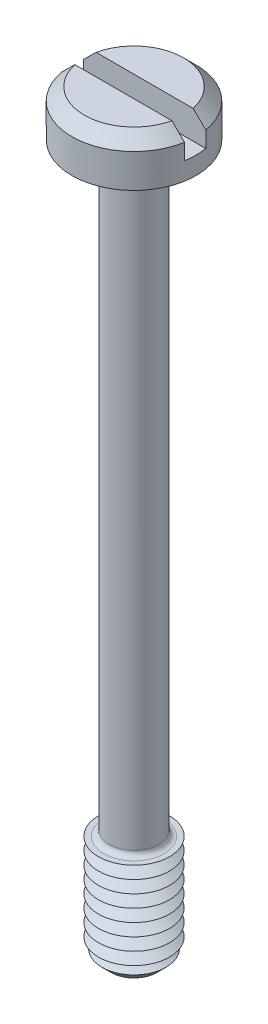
ISO-10303-21;
HEADER;
FILE_DESCRIPTION(('STEP AP214'),'2;1');
FILE_NAME('part.step','',(''),(''),'','','');
FILE_SCHEMA(('AUTOMOTIVE_DESIGN { 1 0 10303 214 1 1 1 1 }'));
ENDSEC;
DATA;
#1=APPLICATION_CONTEXT('core data for automotive mechanical design processes');
#2=APPLICATION_PROTOCOL_DEFINITION('international standard','automotive_design',2000,#1);
#3=PRODUCT_CONTEXT('',#1,'mechanical');
#4=PRODUCT('Part','Part','',(#3));
#5=PRODUCT_RELATED_PRODUCT_CATEGORY('part','',(#4));
#6=PRODUCT_DEFINITION_FORMATION('','',#4);
#7=PRODUCT_DEFINITION_CONTEXT('part definition',#1,'design');
#8=PRODUCT_DEFINITION('design','',#6,#7);
#9=PRODUCT_DEFINITION_SHAPE('','',#8);
#10=(LENGTH_UNIT() NAMED_UNIT(*) SI_UNIT(.MILLI.,.METRE.));
#11=(NAMED_UNIT(*) PLANE_ANGLE_UNIT() SI_UNIT($,.RADIAN.));
#12=(NAMED_UNIT(*) SI_UNIT($,.STERADIAN.) SOLID_ANGLE_UNIT());
#13=UNCERTAINTY_MEASURE_WITH_UNIT(LENGTH_MEASURE(1.E-05),#10,'distance_accuracy_value','');
#14=(GEOMETRIC_REPRESENTATION_CONTEXT(3) GLOBAL_UNCERTAINTY_ASSIGNED_CONTEXT((#13)) GLOBAL_UNIT_ASSIGNED_CONTEXT((#10,
#11,#12)) REPRESENTATION_CONTEXT('',''));
#15=CARTESIAN_POINT('',(0.,0.,0.));
#16=DIRECTION('',(0.,0.,1.));
#17=DIRECTION('',(1.,0.,0.));
#18=AXIS2_PLACEMENT_3D('',#15,#16,#17);
#19=CARTESIAN_POINT('',(0.,2.6,0.));
#20=DIRECTION('',(0.,1.,0.));
#21=DIRECTION('',(0.,0.,1.));
#22=AXIS2_PLACEMENT_3D('',#19,#20,#21);
#23=PLANE('',#22);
#24=DIRECTION('',(-1.,0.,0.));
#25=VECTOR('',#24,1.);
#26=CARTESIAN_POINT('',(3.5,2.6,-0.6));
#27=LINE('',#26,#25);
#28=CARTESIAN_POINT('',(2.73495886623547,2.6,-0.6));
#29=VERTEX_POINT('',#28);
#30=CARTESIAN_POINT('',(-2.73495886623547,2.6,-0.6));
#31=VERTEX_POINT('',#30);
#32=EDGE_CURVE('E110',#29,#31,#27,.T.);
#33=ORIENTED_EDGE('',*,*,#32,.F.);
#34=CARTESIAN_POINT('',(0.,2.6,0.));
#35=DIRECTION('',(0.,1.,0.));
#36=DIRECTION('',(0.,0.,1.));
#37=AXIS2_PLACEMENT_3D('',#34,#35,#36);
#38=CIRCLE('',#37,2.8);
#39=EDGE_CURVE('E113',#29,#31,#38,.T.);
#40=ORIENTED_EDGE('',*,*,#39,.T.);
#41=EDGE_LOOP('',(#33,#40));
#42=FACE_BOUND('',#41,.T.);
#43=ADVANCED_FACE('F39',(#42),#23,.T.);
#44=CARTESIAN_POINT('',(0.,2.6,0.));
#45=DIRECTION('',(0.,-1.,0.));
#46=DIRECTION('',(0.,0.,-1.));
#47=AXIS2_PLACEMENT_3D('',#44,#45,#46);
#48=CONICAL_SURFACE('',#47,2.8,0.785398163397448);
#49=CARTESIAN_POINT('',(7.69779986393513,-2.32114776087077,-0.6));
#50=CARTESIAN_POINT('',(7.42456340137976,-2.0487448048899,-0.6));
#51=CARTESIAN_POINT('',(7.15128998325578,-1.77637887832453,-0.6));
#52=CARTESIAN_POINT('',(6.60460779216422,-1.23176088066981,-0.6));
#53=CARTESIAN_POINT('',(6.33119901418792,-0.959508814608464,-0.6));
#54=CARTESIAN_POINT('',(5.78393918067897,-0.414914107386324,-0.6));
#55=CARTESIAN_POINT('',(5.5100879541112,-0.142571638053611,-0.6));
#56=CARTESIAN_POINT('',(4.9621249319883,0.401829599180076,-0.6));
#57=CARTESIAN_POINT('',(4.68801314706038,0.673888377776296,-0.6));
#58=CARTESIAN_POINT('',(4.15230810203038,1.204717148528,-0.6));
#59=CARTESIAN_POINT('',(3.89073524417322,1.46350771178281,-0.6));
#60=CARTESIAN_POINT('',(3.49781694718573,1.85115830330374,-0.6));
#61=CARTESIAN_POINT('',(3.36674319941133,1.98029362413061,-0.6));
#62=CARTESIAN_POINT('',(3.10433907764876,2.23830030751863,-0.6));
#63=CARTESIAN_POINT('',(2.97300870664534,2.36717167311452,-0.6));
#64=CARTESIAN_POINT('',(2.71005235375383,2.62445652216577,-0.6));
#65=CARTESIAN_POINT('',(2.57842659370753,2.75287023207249,-0.6));
#66=CARTESIAN_POINT('',(2.31459302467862,3.00911021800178,-0.6));
#67=CARTESIAN_POINT('',(2.1823851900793,3.13693646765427,-0.6));
#68=CARTESIAN_POINT('',(1.91706128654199,3.39159289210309,-0.6));
#69=CARTESIAN_POINT('',(1.78394541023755,3.51842326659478,-0.6));
#70=CARTESIAN_POINT('',(1.5829745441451,3.70728046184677,-0.6));
#71=CARTESIAN_POINT('',(1.51577053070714,3.76999922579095,-0.6));
#72=CARTESIAN_POINT('',(1.38073587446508,3.89475766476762,-0.6));
#73=CARTESIAN_POINT('',(1.31290524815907,3.95679735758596,-0.6));
#74=CARTESIAN_POINT('',(1.20662362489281,4.05253127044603,-0.6));
#75=CARTESIAN_POINT('',(1.16849592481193,4.08658409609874,-0.6));
#76=CARTESIAN_POINT('',(1.09186306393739,4.15427097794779,-0.6));
#77=CARTESIAN_POINT('',(1.05335786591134,4.18790499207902,-0.6));
#78=CARTESIAN_POINT('',(0.975560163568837,4.25487029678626,-0.6));
#79=CARTESIAN_POINT('',(0.936263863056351,4.28819718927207,-0.6));
#80=CARTESIAN_POINT('',(0.857023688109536,4.35405392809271,-0.6));
#81=CARTESIAN_POINT('',(0.817079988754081,4.38658398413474,-0.6));
#82=CARTESIAN_POINT('',(0.73593206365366,4.45080389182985,-0.6));
#83=CARTESIAN_POINT('',(0.694719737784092,4.48248357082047,-0.6));
#84=CARTESIAN_POINT('',(0.611023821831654,4.54411116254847,-0.6));
#85=CARTESIAN_POINT('',(0.568540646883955,4.57405963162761,-0.6));
#86=CARTESIAN_POINT('',(0.482031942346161,4.63104137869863,-0.6));
#87=CARTESIAN_POINT('',(0.438018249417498,4.65809235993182,-0.6));
#88=CARTESIAN_POINT('',(0.347545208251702,4.70764477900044,-0.6));
#89=CARTESIAN_POINT('',(0.301093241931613,4.73015905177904,-0.6));
#90=CARTESIAN_POINT('',(0.216840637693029,4.76288589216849,-0.6));
#91=CARTESIAN_POINT('',(0.179711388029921,4.77476119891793,-0.6));
#92=CARTESIAN_POINT('',(0.104069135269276,4.79214056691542,-0.6));
#93=CARTESIAN_POINT('',(0.0655630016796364,4.79767265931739,-0.6));
#94=CARTESIAN_POINT('',(-0.0121083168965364,4.80113734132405,-0.6));
#95=CARTESIAN_POINT('',(-0.0512762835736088,4.79901215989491,-0.6));
#96=CARTESIAN_POINT('',(-0.128601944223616,4.78758103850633,-0.6));
#97=CARTESIAN_POINT('',(-0.166755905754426,4.77825158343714,-0.6));
#98=CARTESIAN_POINT('',(-0.239985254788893,4.75468984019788,-0.6));
#99=CARTESIAN_POINT('',(-0.275121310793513,4.74063623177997,-0.6));
#100=CARTESIAN_POINT('',(-0.343859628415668,4.70912771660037,-0.6));
#101=CARTESIAN_POINT('',(-0.377459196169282,4.6916670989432,-0.6));
#102=CARTESIAN_POINT('',(-0.443620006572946,4.65431398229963,-0.6));
#103=CARTESIAN_POINT('',(-0.476170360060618,4.63440256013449,-0.6));
#104=CARTESIAN_POINT('',(-0.540208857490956,4.59301144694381,-0.6));
#105=CARTESIAN_POINT('',(-0.571697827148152,4.57153301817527,-0.6));
#106=CARTESIAN_POINT('',(-0.636426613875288,4.5256571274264,-0.6));
#107=CARTESIAN_POINT('',(-0.669598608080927,4.50116466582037,-0.6));
#108=CARTESIAN_POINT('',(-0.735238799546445,4.45125092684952,-0.6));
#109=CARTESIAN_POINT('',(-0.767706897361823,4.42582951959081,-0.6));
#110=CARTESIAN_POINT('',(-0.864340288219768,4.34853769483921,-0.6));
#111=CARTESIAN_POINT('',(-0.927700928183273,4.29566444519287,-0.6));
#112=CARTESIAN_POINT('',(-1.05322030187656,4.18829389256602,-0.6));
#113=CARTESIAN_POINT('',(-1.11537654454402,4.13379371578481,-0.6));
#114=CARTESIAN_POINT('',(-1.23879800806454,4.02383276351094,-0.6));
#115=CARTESIAN_POINT('',(-1.30006349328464,3.96837228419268,-0.6));
#116=CARTESIAN_POINT('',(-1.42182653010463,3.85695373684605,-0.6));
#117=CARTESIAN_POINT('',(-1.48232573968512,3.80099747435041,-0.6));
#118=CARTESIAN_POINT('',(-1.60290045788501,3.68862177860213,-0.6));
#119=CARTESIAN_POINT('',(-1.66297593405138,3.63220231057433,-0.6));
#120=CARTESIAN_POINT('',(-1.84259490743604,3.46258196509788,-0.6));
#121=CARTESIAN_POINT('',(-1.96167258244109,3.34888831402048,-0.6));
#122=CARTESIAN_POINT('',(-2.19942862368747,3.12043467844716,-0.6));
#123=CARTESIAN_POINT('',(-2.31810499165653,3.00567262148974,-0.6));
#124=CARTESIAN_POINT('',(-2.55498513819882,2.77566147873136,-0.6));
#125=CARTESIAN_POINT('',(-2.67318891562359,2.66041239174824,-0.6));
#126=CARTESIAN_POINT('',(-3.0273377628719,2.31418176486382,-0.6));
#127=CARTESIAN_POINT('',(-3.26281496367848,2.08272206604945,-0.6));
#128=CARTESIAN_POINT('',(-3.73326607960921,1.61902814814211,-0.6));
#129=CARTESIAN_POINT('',(-3.96823963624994,1.38679356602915,-0.6));
#130=CARTESIAN_POINT('',(-4.43780370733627,0.921942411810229,-0.6));
#131=CARTESIAN_POINT('',(-4.67239422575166,0.6893258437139,-0.6));
#132=CARTESIAN_POINT('',(-5.13982382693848,0.225350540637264,-0.6));
#133=CARTESIAN_POINT('',(-5.37266445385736,-0.00600663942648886,-0.6));
#134=CARTESIAN_POINT('',(-5.83818541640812,-0.468883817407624,-0.6));
#135=CARTESIAN_POINT('',(-6.07086575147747,-0.700403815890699,-0.6));
#136=CARTESIAN_POINT('',(-6.53596926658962,-1.16341429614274,-0.6));
#137=CARTESIAN_POINT('',(-6.76839251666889,-1.39490470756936,-0.6));
#138=CARTESIAN_POINT('',(-7.23315324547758,-1.85796986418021,-0.6));
#139=CARTESIAN_POINT('',(-7.46549072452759,-2.08954460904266,-0.6));
#140=CARTESIAN_POINT('',(-7.69779986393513,-2.32114776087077,-0.6));
#141=B_SPLINE_CURVE_WITH_KNOTS('',3,(#49,#50,#51,#52,#53,#54,#55,#56,#57,#58,#59,#60,#61,#62,
#63,#64,#65,#66,#67,#68,#69,#70,#71,#72,#73,#74,#75,#76,#77,#78,#79,#80,#81,#82,#83,#84,#85,#86,
#87,#88,#89,#90,#91,#92,#93,#94,#95,#96,#97,#98,#99,#100,#101,#102,#103,#104,#105,#106,#107,
#108,#109,#110,#111,#112,#113,#114,#115,#116,#117,#118,#119,#120,#121,#122,#123,#124,#125,#126,
#127,#128,#129,#130,#131,#132,#133,#134,#135,#136,#137,#138,#139,#140),.UNSPECIFIED.,.F.,.F.,(4,
2,2,2,2,2,2,2,2,2,2,2,2,2,2,2,2,2,2,2,2,2,2,2,2,2,2,2,2,2,2,2,2,2,2,2,2,2,2,2,2,2,2,2,2,4),(0.,
1.15747738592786,2.31500139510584,3.47365747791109,4.63226817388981,5.73614050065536,
6.28814234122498,6.84013779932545,7.39180548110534,7.94349768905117,8.49507629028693,
8.77084567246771,9.04660781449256,9.19996738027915,9.35334222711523,9.50791164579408,
9.66243993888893,9.81835637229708,9.9742224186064,10.1290741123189,10.2834813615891,
10.4000294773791,10.5160605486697,10.6329688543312,10.7502603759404,10.8635386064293,
10.9770083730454,11.0914168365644,11.205734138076,11.3294140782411,11.4531113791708,
11.7006314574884,11.9486181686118,12.1965297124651,12.4437540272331,12.6909970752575,
13.184904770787,13.6801705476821,14.1754375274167,15.1659939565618,16.1571087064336,
17.1482131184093,18.1329303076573,19.1176509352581,20.1017623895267,21.0858701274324),.UNSPECIFIED.);
#142=CARTESIAN_POINT('',(3.44818792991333,1.9,-0.6));
#143=VERTEX_POINT('',#142);
#144=EDGE_CURVE('E260',#143,#29,#141,.T.);
#145=ORIENTED_EDGE('',*,*,#144,.F.);
#146=CARTESIAN_POINT('',(0.,1.9,0.));
#147=DIRECTION('',(0.,1.,0.));
#148=DIRECTION('',(0.,0.,1.));
#149=AXIS2_PLACEMENT_3D('',#146,#147,#148);
#150=CIRCLE('',#149,3.5);
#151=CARTESIAN_POINT('',(-3.44818792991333,1.9,-0.6));
#152=VERTEX_POINT('',#151);
#153=EDGE_CURVE('E128',#152,#143,#150,.F.);
#154=ORIENTED_EDGE('',*,*,#153,.F.);
#155=EDGE_CURVE('E102',#31,#152,#141,.T.);
#156=ORIENTED_EDGE('',*,*,#155,.F.);
#157=ORIENTED_EDGE('',*,*,#39,.F.);
#158=EDGE_LOOP('',(#145,#154,#156,#157));
#159=FACE_BOUND('',#158,.T.);
#160=ADVANCED_FACE('F222',(#159),#48,.T.);
#161=CARTESIAN_POINT('',(0.,-40.,0.));
#162=DIRECTION('',(0.,1.,0.));
#163=DIRECTION('',(0.,0.,1.));
#164=AXIS2_PLACEMENT_3D('',#161,#162,#163);
#165=CYLINDRICAL_SURFACE('',#164,1.4);
#166=CARTESIAN_POINT('',(0.,-33.7,0.));
#167=DIRECTION('',(0.,-1.,0.));
#168=DIRECTION('',(0.,0.,-1.));
#169=AXIS2_PLACEMENT_3D('',#166,#167,#168);
#170=CIRCLE('',#169,1.4);
#171=CARTESIAN_POINT('',(0.,-33.7,-1.4));
#172=VERTEX_POINT('',#171);
#173=EDGE_CURVE('E123',#172,#172,#170,.F.);
#174=ORIENTED_EDGE('',*,*,#173,.T.);
#175=EDGE_LOOP('',(#174));
#176=FACE_BOUND('',#175,.T.);
#177=CARTESIAN_POINT('',(0.,-0.300000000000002,0.));
#178=DIRECTION('',(0.,1.,0.));
#179=DIRECTION('',(0.,0.,1.));
#180=AXIS2_PLACEMENT_3D('',#177,#178,#179);
#181=CIRCLE('',#180,1.4);
#182=CARTESIAN_POINT('',(0.,-0.300000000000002,1.4));
#183=VERTEX_POINT('',#182);
#184=EDGE_CURVE('E365',#183,#183,#181,.F.);
#185=ORIENTED_EDGE('',*,*,#184,.T.);
#186=EDGE_LOOP('',(#185));
#187=FACE_BOUND('',#186,.T.);
#188=ADVANCED_FACE('F218',(#176,#187),#165,.T.);
#189=CARTESIAN_POINT('',(0.,2.6,0.));
#190=DIRECTION('',(0.,-1.,0.));
#191=DIRECTION('',(0.,0.,-1.));
#192=AXIS2_PLACEMENT_3D('',#189,#190,#191);
#193=CYLINDRICAL_SURFACE('',#192,3.5);
#194=ORIENTED_EDGE('',*,*,#153,.T.);
#195=DIRECTION('',(0.,-1.,0.));
#196=VECTOR('',#195,1.);
#197=CARTESIAN_POINT('',(3.44818792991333,2.6,-0.6));
#198=LINE('',#197,#196);
#199=CARTESIAN_POINT('',(3.44818792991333,1.,-0.6));
#200=VERTEX_POINT('',#199);
#201=EDGE_CURVE('E64',#143,#200,#198,.T.);
#202=ORIENTED_EDGE('',*,*,#201,.T.);
#203=CARTESIAN_POINT('',(0.,1.,0.));
#204=DIRECTION('',(0.,1.,0.));
#205=DIRECTION('',(0.,0.,1.));
#206=AXIS2_PLACEMENT_3D('',#203,#204,#205);
#207=CIRCLE('',#206,3.5);
#208=CARTESIAN_POINT('',(3.44818792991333,1.,0.6));
#209=VERTEX_POINT('',#208);
#210=EDGE_CURVE('E11',#209,#200,#207,.T.);
#211=ORIENTED_EDGE('',*,*,#210,.F.);
#212=DIRECTION('',(0.,-1.,0.));
#213=VECTOR('',#212,1.);
#214=CARTESIAN_POINT('',(3.44818792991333,2.6,0.6));
#215=LINE('',#214,#213);
#216=CARTESIAN_POINT('',(3.44818792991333,1.9,0.6));
#217=VERTEX_POINT('',#216);
#218=EDGE_CURVE('E276',#209,#217,#215,.F.);
#219=ORIENTED_EDGE('',*,*,#218,.T.);
#220=CARTESIAN_POINT('',(-3.44818792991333,1.9,0.6));
#221=VERTEX_POINT('',#220);
#222=EDGE_CURVE('E120',#217,#221,#150,.F.);
#223=ORIENTED_EDGE('',*,*,#222,.T.);
#224=DIRECTION('',(0.,-1.,0.));
#225=VECTOR('',#224,1.);
#226=CARTESIAN_POINT('',(-3.44818792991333,2.6,0.6));
#227=LINE('',#226,#225);
#228=CARTESIAN_POINT('',(-3.44818792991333,1.,0.6));
#229=VERTEX_POINT('',#228);
#230=EDGE_CURVE('E96',#221,#229,#227,.T.);
#231=ORIENTED_EDGE('',*,*,#230,.T.);
#232=CARTESIAN_POINT('',(-3.44818792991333,1.,-0.6));
#233=VERTEX_POINT('',#232);
#234=EDGE_CURVE('E44',#233,#229,#207,.T.);
#235=ORIENTED_EDGE('',*,*,#234,.F.);
#236=DIRECTION('',(0.,-1.,0.));
#237=VECTOR('',#236,1.);
#238=CARTESIAN_POINT('',(-3.44818792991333,2.6,-0.6));
#239=LINE('',#238,#237);
#240=EDGE_CURVE('E281',#233,#152,#239,.F.);
#241=ORIENTED_EDGE('',*,*,#240,.T.);
#242=EDGE_LOOP('',(#194,#202,#211,#219,#223,#231,#235,#241));
#243=FACE_BOUND('',#242,.T.);
#244=CARTESIAN_POINT('',(0.,0.,0.));
#245=DIRECTION('',(0.,1.,0.));
#246=DIRECTION('',(0.,0.,1.));
#247=AXIS2_PLACEMENT_3D('',#244,#245,#246);
#248=CIRCLE('',#247,3.5);
#249=CARTESIAN_POINT('',(0.,0.,3.5));
#250=VERTEX_POINT('',#249);
#251=EDGE_CURVE('E351',#250,#250,#248,.T.);
#252=ORIENTED_EDGE('',*,*,#251,.T.);
#253=EDGE_LOOP('',(#252));
#254=FACE_BOUND('',#253,.T.);
#255=ADVANCED_FACE('F221',(#243,#254),#193,.T.);
#256=DIRECTION('',(1.,0.,0.));
#257=VECTOR('',#256,1.);
#258=CARTESIAN_POINT('',(3.5,2.6,0.6));
#259=LINE('',#258,#257);
#260=CARTESIAN_POINT('',(-2.73495886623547,2.6,0.6));
#261=VERTEX_POINT('',#260);
#262=CARTESIAN_POINT('',(2.73495886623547,2.6,0.6));
#263=VERTEX_POINT('',#262);
#264=EDGE_CURVE('E56',#261,#263,#259,.T.);
#265=ORIENTED_EDGE('',*,*,#264,.F.);
#266=EDGE_CURVE('E108',#261,#263,#38,.T.);
#267=ORIENTED_EDGE('',*,*,#266,.T.);
#268=EDGE_LOOP('',(#265,#267));
#269=FACE_BOUND('',#268,.T.);
#270=ADVANCED_FACE('F107',(#269),#23,.T.);
#271=CARTESIAN_POINT('',(0.,0.,0.));
#272=DIRECTION('',(0.,1.,0.));
#273=DIRECTION('',(0.,0.,1.));
#274=AXIS2_PLACEMENT_3D('',#271,#272,#273);
#275=PLANE('',#274);
#276=CARTESIAN_POINT('',(0.,0.,0.));
#277=DIRECTION('',(0.,1.,0.));
#278=DIRECTION('',(0.,0.,1.));
#279=AXIS2_PLACEMENT_3D('',#276,#277,#278);
#280=CIRCLE('',#279,1.7);
#281=CARTESIAN_POINT('',(0.,0.,1.7));
#282=VERTEX_POINT('',#281);
#283=EDGE_CURVE('E114',#282,#282,#280,.T.);
#284=ORIENTED_EDGE('',*,*,#283,.T.);
#285=EDGE_LOOP('',(#284));
#286=FACE_BOUND('',#285,.T.);
#287=ORIENTED_EDGE('',*,*,#251,.F.);
#288=EDGE_LOOP('',(#287));
#289=FACE_BOUND('',#288,.T.);
#290=ADVANCED_FACE('F212',(#286,#289),#275,.F.);
#291=CARTESIAN_POINT('',(0.,-34.,0.));
#292=DIRECTION('',(0.,-1.,0.));
#293=DIRECTION('',(0.,0.,-1.));
#294=AXIS2_PLACEMENT_3D('',#291,#292,#293);
#295=PLANE('',#294);
#296=CARTESIAN_POINT('',(0.,-34.,0.));
#297=DIRECTION('',(0.,-1.,0.));
#298=DIRECTION('',(0.,0.,-1.));
#299=AXIS2_PLACEMENT_3D('',#296,#297,#298);
#300=CIRCLE('',#299,1.7);
#301=CARTESIAN_POINT('',(0.,-34.,-1.7));
#302=VERTEX_POINT('',#301);
#303=EDGE_CURVE('E358',#302,#302,#300,.T.);
#304=ORIENTED_EDGE('',*,*,#303,.T.);
#305=EDGE_LOOP('',(#304));
#306=FACE_BOUND('',#305,.T.);
#307=CARTESIAN_POINT('',(0.,-34.,0.));
#308=DIRECTION('',(0.,1.,0.));
#309=DIRECTION('',(0.,0.,1.));
#310=AXIS2_PLACEMENT_3D('',#307,#308,#309);
#311=CIRCLE('',#310,2.);
#312=CARTESIAN_POINT('',(0.,-34.,2.));
#313=VERTEX_POINT('',#312);
#314=EDGE_CURVE('E347',#313,#313,#311,.T.);
#315=ORIENTED_EDGE('',*,*,#314,.T.);
#316=EDGE_LOOP('',(#315));
#317=FACE_BOUND('',#316,.T.);
#318=ADVANCED_FACE('F208',(#306,#317),#295,.F.);
#319=CARTESIAN_POINT('',(0.,-34.35,0.));
#320=DIRECTION('',(0.,1.,0.));
#321=DIRECTION('',(0.,0.,1.));
#322=AXIS2_PLACEMENT_3D('',#319,#320,#321);
#323=CONICAL_SURFACE('',#322,1.39378221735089,1.04719755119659);
#324=ORIENTED_EDGE('',*,*,#314,.F.);
#325=EDGE_LOOP('',(#324));
#326=FACE_BOUND('',#325,.T.);
#327=CARTESIAN_POINT('',(0.,-34.35,0.));
#328=DIRECTION('',(0.,1.,0.));
#329=DIRECTION('',(0.,0.,1.));
#330=AXIS2_PLACEMENT_3D('',#327,#328,#329);
#331=CIRCLE('',#330,1.39378221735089);
#332=CARTESIAN_POINT('',(0.,-34.35,1.39378221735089));
#333=VERTEX_POINT('',#332);
#334=EDGE_CURVE('E343',#333,#333,#331,.T.);
#335=ORIENTED_EDGE('',*,*,#334,.T.);
#336=EDGE_LOOP('',(#335));
#337=FACE_BOUND('',#336,.T.);
#338=ADVANCED_FACE('F204',(#326,#337),#323,.T.);
#339=CARTESIAN_POINT('',(0.,-34.7,0.));
#340=DIRECTION('',(0.,-1.,0.));
#341=DIRECTION('',(0.,0.,-1.));
#342=AXIS2_PLACEMENT_3D('',#339,#340,#341);
#343=CONICAL_SURFACE('',#342,2.,1.0471975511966);
#344=ORIENTED_EDGE('',*,*,#334,.F.);
#345=EDGE_LOOP('',(#344));
#346=FACE_BOUND('',#345,.T.);
#347=CARTESIAN_POINT('',(0.,-34.7,0.));
#348=DIRECTION('',(0.,1.,0.));
#349=DIRECTION('',(0.,0.,1.));
#350=AXIS2_PLACEMENT_3D('',#347,#348,#349);
#351=CIRCLE('',#350,2.);
#352=CARTESIAN_POINT('',(0.,-34.7,2.));
#353=VERTEX_POINT('',#352);
#354=EDGE_CURVE('E339',#353,#353,#351,.T.);
#355=ORIENTED_EDGE('',*,*,#354,.T.);
#356=EDGE_LOOP('',(#355));
#357=FACE_BOUND('',#356,.T.);
#358=ADVANCED_FACE('F200',(#346,#357),#343,.T.);
#359=CARTESIAN_POINT('',(0.,-35.05,0.));
#360=DIRECTION('',(0.,1.,0.));
#361=DIRECTION('',(0.,0.,1.));
#362=AXIS2_PLACEMENT_3D('',#359,#360,#361);
#363=CONICAL_SURFACE('',#362,1.39378221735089,1.04719755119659);
#364=ORIENTED_EDGE('',*,*,#354,.F.);
#365=EDGE_LOOP('',(#364));
#366=FACE_BOUND('',#365,.T.);
#367=CARTESIAN_POINT('',(0.,-35.05,0.));
#368=DIRECTION('',(0.,1.,0.));
#369=DIRECTION('',(0.,0.,1.));
#370=AXIS2_PLACEMENT_3D('',#367,#368,#369);
#371=CIRCLE('',#370,1.39378221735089);
#372=CARTESIAN_POINT('',(0.,-35.05,1.39378221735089));
#373=VERTEX_POINT('',#372);
#374=EDGE_CURVE('E335',#373,#373,#371,.T.);
#375=ORIENTED_EDGE('',*,*,#374,.T.);
#376=EDGE_LOOP('',(#375));
#377=FACE_BOUND('',#376,.T.);
#378=ADVANCED_FACE('F196',(#366,#377),#363,.T.);
#379=CARTESIAN_POINT('',(0.,-35.4,0.));
#380=DIRECTION('',(0.,-1.,0.));
#381=DIRECTION('',(0.,0.,-1.));
#382=AXIS2_PLACEMENT_3D('',#379,#380,#381);
#383=CONICAL_SURFACE('',#382,2.,1.0471975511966);
#384=ORIENTED_EDGE('',*,*,#374,.F.);
#385=EDGE_LOOP('',(#384));
#386=FACE_BOUND('',#385,.T.);
#387=CARTESIAN_POINT('',(0.,-35.4,0.));
#388=DIRECTION('',(0.,1.,0.));
#389=DIRECTION('',(0.,0.,1.));
#390=AXIS2_PLACEMENT_3D('',#387,#388,#389);
#391=CIRCLE('',#390,2.);
#392=CARTESIAN_POINT('',(0.,-35.4,2.));
#393=VERTEX_POINT('',#392);
#394=EDGE_CURVE('E331',#393,#393,#391,.T.);
#395=ORIENTED_EDGE('',*,*,#394,.T.);
#396=EDGE_LOOP('',(#395));
#397=FACE_BOUND('',#396,.T.);
#398=ADVANCED_FACE('F192',(#386,#397),#383,.T.);
#399=CARTESIAN_POINT('',(0.,-35.75,0.));
#400=DIRECTION('',(0.,1.,0.));
#401=DIRECTION('',(0.,0.,1.));
#402=AXIS2_PLACEMENT_3D('',#399,#400,#401);
#403=CONICAL_SURFACE('',#402,1.39378221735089,1.04719755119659);
#404=ORIENTED_EDGE('',*,*,#394,.F.);
#405=EDGE_LOOP('',(#404));
#406=FACE_BOUND('',#405,.T.);
#407=CARTESIAN_POINT('',(0.,-35.75,0.));
#408=DIRECTION('',(0.,1.,0.));
#409=DIRECTION('',(0.,0.,1.));
#410=AXIS2_PLACEMENT_3D('',#407,#408,#409);
#411=CIRCLE('',#410,1.39378221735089);
#412=CARTESIAN_POINT('',(0.,-35.75,1.39378221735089));
#413=VERTEX_POINT('',#412);
#414=EDGE_CURVE('E327',#413,#413,#411,.T.);
#415=ORIENTED_EDGE('',*,*,#414,.T.);
#416=EDGE_LOOP('',(#415));
#417=FACE_BOUND('',#416,.T.);
#418=ADVANCED_FACE('F188',(#406,#417),#403,.T.);
#419=CARTESIAN_POINT('',(0.,-36.1,0.));
#420=DIRECTION('',(0.,-1.,0.));
#421=DIRECTION('',(0.,0.,-1.));
#422=AXIS2_PLACEMENT_3D('',#419,#420,#421);
#423=CONICAL_SURFACE('',#422,2.,1.0471975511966);
#424=ORIENTED_EDGE('',*,*,#414,.F.);
#425=EDGE_LOOP('',(#424));
#426=FACE_BOUND('',#425,.T.);
#427=CARTESIAN_POINT('',(0.,-36.1,0.));
#428=DIRECTION('',(0.,1.,0.));
#429=DIRECTION('',(0.,0.,1.));
#430=AXIS2_PLACEMENT_3D('',#427,#428,#429);
#431=CIRCLE('',#430,2.);
#432=CARTESIAN_POINT('',(0.,-36.1,2.));
#433=VERTEX_POINT('',#432);
#434=EDGE_CURVE('E323',#433,#433,#431,.T.);
#435=ORIENTED_EDGE('',*,*,#434,.T.);
#436=EDGE_LOOP('',(#435));
#437=FACE_BOUND('',#436,.T.);
#438=ADVANCED_FACE('F184',(#426,#437),#423,.T.);
#439=CARTESIAN_POINT('',(0.,-36.45,0.));
#440=DIRECTION('',(0.,1.,0.));
#441=DIRECTION('',(0.,0.,1.));
#442=AXIS2_PLACEMENT_3D('',#439,#440,#441);
#443=CONICAL_SURFACE('',#442,1.39378221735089,1.04719755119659);
#444=ORIENTED_EDGE('',*,*,#434,.F.);
#445=EDGE_LOOP('',(#444));
#446=FACE_BOUND('',#445,.T.);
#447=CARTESIAN_POINT('',(0.,-36.45,0.));
#448=DIRECTION('',(0.,1.,0.));
#449=DIRECTION('',(0.,0.,1.));
#450=AXIS2_PLACEMENT_3D('',#447,#448,#449);
#451=CIRCLE('',#450,1.39378221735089);
#452=CARTESIAN_POINT('',(0.,-36.45,1.39378221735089));
#453=VERTEX_POINT('',#452);
#454=EDGE_CURVE('E319',#453,#453,#451,.T.);
#455=ORIENTED_EDGE('',*,*,#454,.T.);
#456=EDGE_LOOP('',(#455));
#457=FACE_BOUND('',#456,.T.);
#458=ADVANCED_FACE('F180',(#446,#457),#443,.T.);
#459=CARTESIAN_POINT('',(0.,-36.8,0.));
#460=DIRECTION('',(0.,-1.,0.));
#461=DIRECTION('',(0.,0.,-1.));
#462=AXIS2_PLACEMENT_3D('',#459,#460,#461);
#463=CONICAL_SURFACE('',#462,2.,1.0471975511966);
#464=ORIENTED_EDGE('',*,*,#454,.F.);
#465=EDGE_LOOP('',(#464));
#466=FACE_BOUND('',#465,.T.);
#467=CARTESIAN_POINT('',(0.,-36.8,0.));
#468=DIRECTION('',(0.,1.,0.));
#469=DIRECTION('',(0.,0.,1.));
#470=AXIS2_PLACEMENT_3D('',#467,#468,#469);
#471=CIRCLE('',#470,2.);
#472=CARTESIAN_POINT('',(0.,-36.8,2.));
#473=VERTEX_POINT('',#472);
#474=EDGE_CURVE('E316',#473,#473,#471,.T.);
#475=ORIENTED_EDGE('',*,*,#474,.T.);
#476=EDGE_LOOP('',(#475));
#477=FACE_BOUND('',#476,.T.);
#478=ADVANCED_FACE('F176',(#466,#477),#463,.T.);
#479=CARTESIAN_POINT('',(0.,-37.15,0.));
#480=DIRECTION('',(0.,1.,0.));
#481=DIRECTION('',(0.,0.,1.));
#482=AXIS2_PLACEMENT_3D('',#479,#480,#481);
#483=CONICAL_SURFACE('',#482,1.39378221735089,1.04719755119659);
#484=ORIENTED_EDGE('',*,*,#474,.F.);
#485=EDGE_LOOP('',(#484));
#486=FACE_BOUND('',#485,.T.);
#487=CARTESIAN_POINT('',(0.,-37.15,0.));
#488=DIRECTION('',(0.,1.,0.));
#489=DIRECTION('',(0.,0.,1.));
#490=AXIS2_PLACEMENT_3D('',#487,#488,#489);
#491=CIRCLE('',#490,1.39378221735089);
#492=CARTESIAN_POINT('',(0.,-37.15,1.39378221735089));
#493=VERTEX_POINT('',#492);
#494=EDGE_CURVE('E313',#493,#493,#491,.T.);
#495=ORIENTED_EDGE('',*,*,#494,.T.);
#496=EDGE_LOOP('',(#495));
#497=FACE_BOUND('',#496,.T.);
#498=ADVANCED_FACE('F172',(#486,#497),#483,.T.);
#499=CARTESIAN_POINT('',(0.,-37.5,0.));
#500=DIRECTION('',(0.,-1.,0.));
#501=DIRECTION('',(0.,0.,-1.));
#502=AXIS2_PLACEMENT_3D('',#499,#500,#501);
#503=CONICAL_SURFACE('',#502,2.,1.0471975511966);
#504=ORIENTED_EDGE('',*,*,#494,.F.);
#505=EDGE_LOOP('',(#504));
#506=FACE_BOUND('',#505,.T.);
#507=CARTESIAN_POINT('',(0.,-37.5,0.));
#508=DIRECTION('',(0.,1.,0.));
#509=DIRECTION('',(0.,0.,1.));
#510=AXIS2_PLACEMENT_3D('',#507,#508,#509);
#511=CIRCLE('',#510,2.);
#512=CARTESIAN_POINT('',(0.,-37.5,2.));
#513=VERTEX_POINT('',#512);
#514=EDGE_CURVE('E309',#513,#513,#511,.T.);
#515=ORIENTED_EDGE('',*,*,#514,.T.);
#516=EDGE_LOOP('',(#515));
#517=FACE_BOUND('',#516,.T.);
#518=ADVANCED_FACE('F168',(#506,#517),#503,.T.);
#519=CARTESIAN_POINT('',(0.,-37.85,0.));
#520=DIRECTION('',(0.,1.,0.));
#521=DIRECTION('',(0.,0.,1.));
#522=AXIS2_PLACEMENT_3D('',#519,#520,#521);
#523=CONICAL_SURFACE('',#522,1.39378221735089,1.04719755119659);
#524=ORIENTED_EDGE('',*,*,#514,.F.);
#525=EDGE_LOOP('',(#524));
#526=FACE_BOUND('',#525,.T.);
#527=CARTESIAN_POINT('',(0.,-37.85,0.));
#528=DIRECTION('',(0.,1.,0.));
#529=DIRECTION('',(0.,0.,1.));
#530=AXIS2_PLACEMENT_3D('',#527,#528,#529);
#531=CIRCLE('',#530,1.39378221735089);
#532=CARTESIAN_POINT('',(0.,-37.85,1.39378221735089));
#533=VERTEX_POINT('',#532);
#534=EDGE_CURVE('E306',#533,#533,#531,.T.);
#535=ORIENTED_EDGE('',*,*,#534,.T.);
#536=EDGE_LOOP('',(#535));
#537=FACE_BOUND('',#536,.T.);
#538=ADVANCED_FACE('F164',(#526,#537),#523,.T.);
#539=CARTESIAN_POINT('',(0.,-38.2,0.));
#540=DIRECTION('',(0.,-1.,0.));
#541=DIRECTION('',(0.,0.,-1.));
#542=AXIS2_PLACEMENT_3D('',#539,#540,#541);
#543=CONICAL_SURFACE('',#542,2.,1.0471975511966);
#544=ORIENTED_EDGE('',*,*,#534,.F.);
#545=EDGE_LOOP('',(#544));
#546=FACE_BOUND('',#545,.T.);
#547=CARTESIAN_POINT('',(0.,-38.2,0.));
#548=DIRECTION('',(0.,1.,0.));
#549=DIRECTION('',(0.,0.,1.));
#550=AXIS2_PLACEMENT_3D('',#547,#548,#549);
#551=CIRCLE('',#550,2.);
#552=CARTESIAN_POINT('',(0.,-38.2,2.));
#553=VERTEX_POINT('',#552);
#554=EDGE_CURVE('E302',#553,#553,#551,.T.);
#555=ORIENTED_EDGE('',*,*,#554,.T.);
#556=EDGE_LOOP('',(#555));
#557=FACE_BOUND('',#556,.T.);
#558=ADVANCED_FACE('F160',(#546,#557),#543,.T.);
#559=CARTESIAN_POINT('',(0.,-38.55,0.));
#560=DIRECTION('',(0.,1.,0.));
#561=DIRECTION('',(0.,0.,1.));
#562=AXIS2_PLACEMENT_3D('',#559,#560,#561);
#563=CONICAL_SURFACE('',#562,1.39378221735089,1.04719755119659);
#564=ORIENTED_EDGE('',*,*,#554,.F.);
#565=EDGE_LOOP('',(#564));
#566=FACE_BOUND('',#565,.T.);
#567=CARTESIAN_POINT('',(0.,-38.55,0.));
#568=DIRECTION('',(0.,1.,0.));
#569=DIRECTION('',(0.,0.,1.));
#570=AXIS2_PLACEMENT_3D('',#567,#568,#569);
#571=CIRCLE('',#570,1.39378221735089);
#572=CARTESIAN_POINT('',(0.,-38.55,1.39378221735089));
#573=VERTEX_POINT('',#572);
#574=EDGE_CURVE('E299',#573,#573,#571,.T.);
#575=ORIENTED_EDGE('',*,*,#574,.T.);
#576=EDGE_LOOP('',(#575));
#577=FACE_BOUND('',#576,.T.);
#578=ADVANCED_FACE('F156',(#566,#577),#563,.T.);
#579=CARTESIAN_POINT('',(0.,-38.9,0.));
#580=DIRECTION('',(0.,-1.,0.));
#581=DIRECTION('',(0.,0.,-1.));
#582=AXIS2_PLACEMENT_3D('',#579,#580,#581);
#583=CONICAL_SURFACE('',#582,2.,1.0471975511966);
#584=ORIENTED_EDGE('',*,*,#574,.F.);
#585=EDGE_LOOP('',(#584));
#586=FACE_BOUND('',#585,.T.);
#587=CARTESIAN_POINT('',(0.,-38.9,0.));
#588=DIRECTION('',(0.,1.,0.));
#589=DIRECTION('',(0.,0.,1.));
#590=AXIS2_PLACEMENT_3D('',#587,#588,#589);
#591=CIRCLE('',#590,2.);
#592=CARTESIAN_POINT('',(0.,-38.9,2.));
#593=VERTEX_POINT('',#592);
#594=EDGE_CURVE('E294',#593,#593,#591,.T.);
#595=ORIENTED_EDGE('',*,*,#594,.T.);
#596=EDGE_LOOP('',(#595));
#597=FACE_BOUND('',#596,.T.);
#598=ADVANCED_FACE('F152',(#586,#597),#583,.T.);
#599=CARTESIAN_POINT('',(0.,-39.25,0.));
#600=DIRECTION('',(0.,1.,0.));
#601=DIRECTION('',(0.,0.,1.));
#602=AXIS2_PLACEMENT_3D('',#599,#600,#601);
#603=CONICAL_SURFACE('',#602,1.39378221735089,1.04719755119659);
#604=ORIENTED_EDGE('',*,*,#594,.F.);
#605=EDGE_LOOP('',(#604));
#606=FACE_BOUND('',#605,.T.);
#607=CARTESIAN_POINT('',(0.,-39.25,0.));
#608=DIRECTION('',(0.,1.,0.));
#609=DIRECTION('',(0.,0.,1.));
#610=AXIS2_PLACEMENT_3D('',#607,#608,#609);
#611=CIRCLE('',#610,1.39378221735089);
#612=CARTESIAN_POINT('',(0.,-39.25,1.39378221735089));
#613=VERTEX_POINT('',#612);
#614=EDGE_CURVE('E291',#613,#613,#611,.T.);
#615=ORIENTED_EDGE('',*,*,#614,.T.);
#616=EDGE_LOOP('',(#615));
#617=FACE_BOUND('',#616,.T.);
#618=ADVANCED_FACE('F148',(#606,#617),#603,.T.);
#619=CARTESIAN_POINT('',(0.,-39.6,0.));
#620=DIRECTION('',(0.,-1.,0.));
#621=DIRECTION('',(0.,0.,-1.));
#622=AXIS2_PLACEMENT_3D('',#619,#620,#621);
#623=CONICAL_SURFACE('',#622,2.,1.0471975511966);
#624=CARTESIAN_POINT('',(0.,-39.4901923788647,0.));
#625=DIRECTION('',(0.,-1.,0.));
#626=DIRECTION('',(0.,0.,-1.));
#627=AXIS2_PLACEMENT_3D('',#624,#625,#626);
#628=CIRCLE('',#627,1.80980762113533);
#629=CARTESIAN_POINT('',(0.,-39.4901923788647,1.80980762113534));
#630=VERTEX_POINT('',#629);
#631=EDGE_CURVE('E298',#630,#630,#628,.F.);
#632=ORIENTED_EDGE('',*,*,#631,.T.);
#633=EDGE_LOOP('',(#632));
#634=FACE_BOUND('',#633,.T.);
#635=ORIENTED_EDGE('',*,*,#614,.F.);
#636=EDGE_LOOP('',(#635));
#637=FACE_BOUND('',#636,.T.);
#638=ADVANCED_FACE('F144',(#634,#637),#623,.T.);
#639=CARTESIAN_POINT('',(0.,-40.,0.));
#640=DIRECTION('',(0.,-1.,0.));
#641=DIRECTION('',(0.,0.,-1.));
#642=AXIS2_PLACEMENT_3D('',#639,#640,#641);
#643=PLANE('',#642);
#644=CARTESIAN_POINT('',(0.,-40.,0.));
#645=DIRECTION('',(0.,-1.,0.));
#646=DIRECTION('',(0.,0.,-1.));
#647=AXIS2_PLACEMENT_3D('',#644,#645,#646);
#648=CIRCLE('',#647,1.3);
#649=CARTESIAN_POINT('',(0.,-40.,1.30000000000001));
#650=VERTEX_POINT('',#649);
#651=EDGE_CURVE('E355',#650,#650,#648,.T.);
#652=ORIENTED_EDGE('',*,*,#651,.T.);
#653=EDGE_LOOP('',(#652));
#654=FACE_BOUND('',#653,.T.);
#655=ADVANCED_FACE('F147',(#654),#643,.T.);
#656=CARTESIAN_POINT('',(0.,-40.,0.));
#657=DIRECTION('',(0.,1.,0.));
#658=DIRECTION('',(0.,0.,1.));
#659=AXIS2_PLACEMENT_3D('',#656,#657,#658);
#660=CONICAL_SURFACE('',#659,1.3,0.785398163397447);
#661=CARTESIAN_POINT('',(0.,-39.4901923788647,1.80980762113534));
#662=CARTESIAN_POINT('',(0.,-39.4955028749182,1.80449712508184));
#663=CARTESIAN_POINT('',(0.,-39.5008133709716,1.79918662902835));
#664=CARTESIAN_POINT('',(0.,-39.5114343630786,1.78856563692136));
#665=CARTESIAN_POINT('',(0.,-39.5167448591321,1.78325514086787));
#666=CARTESIAN_POINT('',(0.,-39.5273658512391,1.77263414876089));
#667=CARTESIAN_POINT('',(0.,-39.5326763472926,1.76732365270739));
#668=CARTESIAN_POINT('',(0.,-39.5432973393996,1.75670266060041));
#669=CARTESIAN_POINT('',(0.,-39.5486078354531,1.75139216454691));
#670=CARTESIAN_POINT('',(0.,-39.5592288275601,1.74077117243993));
#671=CARTESIAN_POINT('',(0.,-39.5645393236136,1.73546067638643));
#672=CARTESIAN_POINT('',(0.,-39.5751603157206,1.72483968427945));
#673=CARTESIAN_POINT('',(0.,-39.580470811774,1.71952918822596));
#674=CARTESIAN_POINT('',(0.,-39.591091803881,1.70890819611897));
#675=CARTESIAN_POINT('',(0.,-39.5964022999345,1.70359770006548));
#676=CARTESIAN_POINT('',(0.,-39.6070232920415,1.69297670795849));
#677=CARTESIAN_POINT('',(0.,-39.612333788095,1.687666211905));
#678=CARTESIAN_POINT('',(0.,-39.622954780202,1.67704521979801));
#679=CARTESIAN_POINT('',(0.,-39.6282652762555,1.67173472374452));
#680=CARTESIAN_POINT('',(0.,-39.6388862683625,1.66111373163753));
#681=CARTESIAN_POINT('',(0.,-39.644196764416,1.65580323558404));
#682=CARTESIAN_POINT('',(0.,-39.654817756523,1.64518224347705));
#683=CARTESIAN_POINT('',(0.,-39.6601282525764,1.63987174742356));
#684=CARTESIAN_POINT('',(0.,-39.6707492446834,1.62925075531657));
#685=CARTESIAN_POINT('',(0.,-39.6760597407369,1.62394025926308));
#686=CARTESIAN_POINT('',(0.,-39.6866807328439,1.61331926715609));
#687=CARTESIAN_POINT('',(0.,-39.6919912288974,1.6080087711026));
#688=CARTESIAN_POINT('',(0.,-39.7026122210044,1.59738777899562));
#689=CARTESIAN_POINT('',(0.,-39.7079227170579,1.59207728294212));
#690=CARTESIAN_POINT('',(0.,-39.7185437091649,1.58145629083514));
#691=CARTESIAN_POINT('',(0.,-39.7238542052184,1.57614579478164));
#692=CARTESIAN_POINT('',(0.,-39.7344751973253,1.56552480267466));
#693=CARTESIAN_POINT('',(0.,-39.7397856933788,1.56021430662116));
#694=CARTESIAN_POINT('',(0.,-39.7504066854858,1.54959331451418));
#695=CARTESIAN_POINT('',(0.,-39.7557171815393,1.54428281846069));
#696=CARTESIAN_POINT('',(0.,-39.7663381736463,1.5336618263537));
#697=CARTESIAN_POINT('',(0.,-39.7716486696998,1.52835133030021));
#698=CARTESIAN_POINT('',(0.,-39.7822696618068,1.51773033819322));
#699=CARTESIAN_POINT('',(0.,-39.7875801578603,1.51241984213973));
#700=CARTESIAN_POINT('',(0.,-39.7982011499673,1.50179885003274));
#701=CARTESIAN_POINT('',(0.,-39.8035116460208,1.49648835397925));
#702=CARTESIAN_POINT('',(0.,-39.8141326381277,1.48586736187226));
#703=CARTESIAN_POINT('',(0.,-39.8194431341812,1.48055686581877));
#704=CARTESIAN_POINT('',(0.,-39.8300641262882,1.46993587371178));
#705=CARTESIAN_POINT('',(0.,-39.8353746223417,1.46462537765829));
#706=CARTESIAN_POINT('',(0.,-39.8459956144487,1.4540043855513));
#707=CARTESIAN_POINT('',(0.,-39.8513061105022,1.44869388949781));
#708=CARTESIAN_POINT('',(0.,-39.8619271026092,1.43807289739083));
#709=CARTESIAN_POINT('',(0.,-39.8672375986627,1.43276240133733));
#710=CARTESIAN_POINT('',(0.,-39.8778585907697,1.42214140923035));
#711=CARTESIAN_POINT('',(0.,-39.8831690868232,1.41683091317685));
#712=CARTESIAN_POINT('',(0.,-39.8937900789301,1.40620992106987));
#713=CARTESIAN_POINT('',(0.,-39.8991005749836,1.40089942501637));
#714=CARTESIAN_POINT('',(0.,-39.9097215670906,1.39027843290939));
#715=CARTESIAN_POINT('',(0.,-39.9150320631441,1.38496793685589));
#716=CARTESIAN_POINT('',(0.,-39.9256530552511,1.37434694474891));
#717=CARTESIAN_POINT('',(0.,-39.9309635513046,1.36903644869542));
#718=CARTESIAN_POINT('',(0.,-39.9415845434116,1.35841545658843));
#719=CARTESIAN_POINT('',(0.,-39.9468950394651,1.35310496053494));
#720=CARTESIAN_POINT('',(0.,-39.957516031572,1.34248396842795));
#721=CARTESIAN_POINT('',(0.,-39.9628265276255,1.33717347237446));
#722=CARTESIAN_POINT('',(0.,-39.9734475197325,1.32655248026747));
#723=CARTESIAN_POINT('',(0.,-39.978758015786,1.32124198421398));
#724=CARTESIAN_POINT('',(0.,-39.989379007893,1.31062099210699));
#725=CARTESIAN_POINT('',(0.,-39.9946895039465,1.3053104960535));
#726=CARTESIAN_POINT('',(0.,-40.,1.30000000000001));
#727=B_SPLINE_CURVE_WITH_KNOTS('',3,(#661,#662,#663,#664,#665,#666,#667,#668,#669,#670,#671,
#672,#673,#674,#675,#676,#677,#678,#679,#680,#681,#682,#683,#684,#685,#686,#687,#688,#689,#690,
#691,#692,#693,#694,#695,#696,#697,#698,#699,#700,#701,#702,#703,#704,#705,#706,#707,#708,#709,
#710,#711,#712,#713,#714,#715,#716,#717,#718,#719,#720,#721,#722,#723,#724,#725,#726),
.UNSPECIFIED.,.F.,.F.,(4,2,2,2,2,2,2,2,2,2,2,2,2,2,2,2,2,2,2,2,2,2,2,2,2,2,2,2,2,2,2,2,4),(0.,
0.0225305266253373,0.0450610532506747,0.067591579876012,0.0901221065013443,0.112652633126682,
0.135183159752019,0.157713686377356,0.180244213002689,0.202774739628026,0.225305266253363,
0.247835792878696,0.270366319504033,0.29289684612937,0.315427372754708,0.33795789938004,
0.360488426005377,0.383018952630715,0.405549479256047,0.428080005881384,0.450610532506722,
0.473141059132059,0.495671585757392,0.518202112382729,0.540732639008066,0.563263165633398,
0.585793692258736,0.608324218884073,0.63085474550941,0.653385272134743,0.67591579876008,
0.698446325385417,0.720976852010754),.UNSPECIFIED.);
#728=EDGE_CURVE('BSEAM216',#630,#650,#727,.T.);
#729=ORIENTED_EDGE('',*,*,#631,.F.);
#730=ORIENTED_EDGE('',*,*,#651,.F.);
#731=ORIENTED_EDGE('',*,*,#728,.T.);
#732=ORIENTED_EDGE('',*,*,#728,.F.);
#733=EDGE_LOOP('',(#729,#731,#730,#732));
#734=FACE_BOUND('',#733,.T.);
#735=ADVANCED_FACE('F216',(#734),#660,.T.);
#736=CARTESIAN_POINT('',(0.,-33.7,0.));
#737=DIRECTION('',(0.,-1.,0.));
#738=DIRECTION('',(0.,0.,-1.));
#739=AXIS2_PLACEMENT_3D('',#736,#737,#738);
#740=TOROIDAL_SURFACE('',#739,1.7,0.3);
#741=ORIENTED_EDGE('',*,*,#173,.F.);
#742=EDGE_LOOP('',(#741));
#743=FACE_BOUND('',#742,.T.);
#744=ORIENTED_EDGE('',*,*,#303,.F.);
#745=EDGE_LOOP('',(#744));
#746=FACE_BOUND('',#745,.T.);
#747=ADVANCED_FACE('F234',(#743,#746),#740,.F.);
#748=CARTESIAN_POINT('',(0.,-0.300000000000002,0.));
#749=DIRECTION('',(0.,1.,0.));
#750=DIRECTION('',(0.,0.,1.));
#751=AXIS2_PLACEMENT_3D('',#748,#749,#750);
#752=TOROIDAL_SURFACE('',#751,1.7,0.3);
#753=ORIENTED_EDGE('',*,*,#283,.F.);
#754=EDGE_LOOP('',(#753));
#755=FACE_BOUND('',#754,.T.);
#756=ORIENTED_EDGE('',*,*,#184,.F.);
#757=EDGE_LOOP('',(#756));
#758=FACE_BOUND('',#757,.T.);
#759=ADVANCED_FACE('F237',(#755,#758),#752,.F.);
#760=CARTESIAN_POINT('',(-7.69779986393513,-2.32114776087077,0.6));
#761=CARTESIAN_POINT('',(-7.42456340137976,-2.04874480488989,0.6));
#762=CARTESIAN_POINT('',(-7.15128998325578,-1.77637887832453,0.6));
#763=CARTESIAN_POINT('',(-6.60460779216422,-1.23176088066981,0.6));
#764=CARTESIAN_POINT('',(-6.33119901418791,-0.959508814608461,0.6));
#765=CARTESIAN_POINT('',(-5.78393918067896,-0.414914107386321,0.6));
#766=CARTESIAN_POINT('',(-5.5100879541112,-0.142571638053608,0.6));
#767=CARTESIAN_POINT('',(-4.9621249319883,0.401829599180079,0.6));
#768=CARTESIAN_POINT('',(-4.68801314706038,0.673888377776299,0.6));
#769=CARTESIAN_POINT('',(-4.15230810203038,1.204717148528,0.6));
#770=CARTESIAN_POINT('',(-3.89073524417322,1.46350771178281,0.6));
#771=CARTESIAN_POINT('',(-3.49781694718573,1.85115830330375,0.6));
#772=CARTESIAN_POINT('',(-3.36674319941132,1.98029362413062,0.6));
#773=CARTESIAN_POINT('',(-3.10433907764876,2.23830030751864,0.6));
#774=CARTESIAN_POINT('',(-2.97300870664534,2.36717167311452,0.6));
#775=CARTESIAN_POINT('',(-2.71005235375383,2.62445652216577,0.6));
#776=CARTESIAN_POINT('',(-2.57842659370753,2.75287023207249,0.6));
#777=CARTESIAN_POINT('',(-2.31459302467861,3.00911021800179,0.6));
#778=CARTESIAN_POINT('',(-2.1823851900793,3.13693646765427,0.6));
#779=CARTESIAN_POINT('',(-1.91706128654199,3.39159289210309,0.6));
#780=CARTESIAN_POINT('',(-1.78394541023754,3.51842326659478,0.6));
#781=CARTESIAN_POINT('',(-1.5829745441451,3.70728046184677,0.6));
#782=CARTESIAN_POINT('',(-1.51577053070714,3.76999922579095,0.6));
#783=CARTESIAN_POINT('',(-1.38073587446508,3.89475766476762,0.6));
#784=CARTESIAN_POINT('',(-1.31290524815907,3.95679735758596,0.6));
#785=CARTESIAN_POINT('',(-1.20662362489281,4.05253127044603,0.6));
#786=CARTESIAN_POINT('',(-1.16849592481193,4.08658409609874,0.6));
#787=CARTESIAN_POINT('',(-1.09186306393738,4.15427097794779,0.6));
#788=CARTESIAN_POINT('',(-1.05335786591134,4.18790499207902,0.6));
#789=CARTESIAN_POINT('',(-0.975560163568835,4.25487029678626,0.6));
#790=CARTESIAN_POINT('',(-0.936263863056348,4.28819718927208,0.6));
#791=CARTESIAN_POINT('',(-0.857023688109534,4.35405392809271,0.6));
#792=CARTESIAN_POINT('',(-0.817079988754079,4.38658398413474,0.6));
#793=CARTESIAN_POINT('',(-0.735932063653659,4.45080389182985,0.6));
#794=CARTESIAN_POINT('',(-0.694719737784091,4.48248357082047,0.6));
#795=CARTESIAN_POINT('',(-0.611023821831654,4.54411116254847,0.6));
#796=CARTESIAN_POINT('',(-0.568540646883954,4.57405963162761,0.6));
#797=CARTESIAN_POINT('',(-0.482031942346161,4.63104137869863,0.6));
#798=CARTESIAN_POINT('',(-0.438018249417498,4.65809235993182,0.6));
#799=CARTESIAN_POINT('',(-0.347545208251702,4.70764477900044,0.6));
#800=CARTESIAN_POINT('',(-0.301093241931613,4.73015905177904,0.6));
#801=CARTESIAN_POINT('',(-0.216840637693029,4.76288589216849,0.6));
#802=CARTESIAN_POINT('',(-0.179711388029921,4.77476119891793,0.6));
#803=CARTESIAN_POINT('',(-0.104069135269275,4.79214056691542,0.6));
#804=CARTESIAN_POINT('',(-0.065563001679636,4.79767265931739,0.6));
#805=CARTESIAN_POINT('',(0.0121083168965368,4.80113734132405,0.6));
#806=CARTESIAN_POINT('',(0.0512762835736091,4.79901215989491,0.6));
#807=CARTESIAN_POINT('',(0.128601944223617,4.78758103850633,0.6));
#808=CARTESIAN_POINT('',(0.166755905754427,4.77825158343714,0.6));
#809=CARTESIAN_POINT('',(0.239985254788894,4.75468984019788,0.6));
#810=CARTESIAN_POINT('',(0.275121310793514,4.74063623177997,0.6));
#811=CARTESIAN_POINT('',(0.343859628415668,4.70912771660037,0.6));
#812=CARTESIAN_POINT('',(0.377459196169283,4.6916670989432,0.6));
#813=CARTESIAN_POINT('',(0.443620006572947,4.65431398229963,0.6));
#814=CARTESIAN_POINT('',(0.476170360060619,4.63440256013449,0.6));
#815=CARTESIAN_POINT('',(0.540208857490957,4.59301144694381,0.6));
#816=CARTESIAN_POINT('',(0.571697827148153,4.57153301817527,0.6));
#817=CARTESIAN_POINT('',(0.63642661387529,4.5256571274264,0.6));
#818=CARTESIAN_POINT('',(0.669598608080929,4.50116466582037,0.6));
#819=CARTESIAN_POINT('',(0.735238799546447,4.45125092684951,0.6));
#820=CARTESIAN_POINT('',(0.767706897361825,4.42582951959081,0.6));
#821=CARTESIAN_POINT('',(0.864340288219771,4.3485376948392,0.6));
#822=CARTESIAN_POINT('',(0.927700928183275,4.29566444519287,0.6));
#823=CARTESIAN_POINT('',(1.05322030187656,4.18829389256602,0.6));
#824=CARTESIAN_POINT('',(1.11537654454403,4.1337937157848,0.6));
#825=CARTESIAN_POINT('',(1.23879800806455,4.02383276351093,0.6));
#826=CARTESIAN_POINT('',(1.30006349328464,3.96837228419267,0.6));
#827=CARTESIAN_POINT('',(1.42182653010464,3.85695373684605,0.6));
#828=CARTESIAN_POINT('',(1.48232573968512,3.80099747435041,0.6));
#829=CARTESIAN_POINT('',(1.60290045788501,3.68862177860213,0.6));
#830=CARTESIAN_POINT('',(1.66297593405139,3.63220231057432,0.6));
#831=CARTESIAN_POINT('',(1.84259490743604,3.46258196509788,0.6));
#832=CARTESIAN_POINT('',(1.96167258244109,3.34888831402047,0.6));
#833=CARTESIAN_POINT('',(2.19942862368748,3.12043467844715,0.6));
#834=CARTESIAN_POINT('',(2.31810499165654,3.00567262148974,0.6));
#835=CARTESIAN_POINT('',(2.55498513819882,2.77566147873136,0.6));
#836=CARTESIAN_POINT('',(2.67318891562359,2.66041239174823,0.6));
#837=CARTESIAN_POINT('',(3.0273377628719,2.31418176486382,0.6));
#838=CARTESIAN_POINT('',(3.26281496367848,2.08272206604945,0.6));
#839=CARTESIAN_POINT('',(3.73326607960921,1.61902814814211,0.6));
#840=CARTESIAN_POINT('',(3.96823963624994,1.38679356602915,0.6));
#841=CARTESIAN_POINT('',(4.43780370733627,0.921942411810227,0.6));
#842=CARTESIAN_POINT('',(4.67239422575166,0.689325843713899,0.6));
#843=CARTESIAN_POINT('',(5.13982382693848,0.225350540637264,0.6));
#844=CARTESIAN_POINT('',(5.37266445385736,-0.00600663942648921,0.6));
#845=CARTESIAN_POINT('',(5.83818541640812,-0.468883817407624,0.6));
#846=CARTESIAN_POINT('',(6.07086575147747,-0.700403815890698,0.6));
#847=CARTESIAN_POINT('',(6.53596926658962,-1.16341429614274,0.6));
#848=CARTESIAN_POINT('',(6.76839251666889,-1.39490470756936,0.6));
#849=CARTESIAN_POINT('',(7.23315324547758,-1.85796986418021,0.6));
#850=CARTESIAN_POINT('',(7.46549072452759,-2.08954460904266,0.6));
#851=CARTESIAN_POINT('',(7.69779986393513,-2.32114776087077,0.6));
#852=B_SPLINE_CURVE_WITH_KNOTS('',3,(#760,#761,#762,#763,#764,#765,#766,#767,#768,#769,#770,
#771,#772,#773,#774,#775,#776,#777,#778,#779,#780,#781,#782,#783,#784,#785,#786,#787,#788,#789,
#790,#791,#792,#793,#794,#795,#796,#797,#798,#799,#800,#801,#802,#803,#804,#805,#806,#807,#808,
#809,#810,#811,#812,#813,#814,#815,#816,#817,#818,#819,#820,#821,#822,#823,#824,#825,#826,#827,
#828,#829,#830,#831,#832,#833,#834,#835,#836,#837,#838,#839,#840,#841,#842,#843,#844,#845,#846,
#847,#848,#849,#850,#851),.UNSPECIFIED.,.F.,.F.,(4,2,2,2,2,2,2,2,2,2,2,2,2,2,2,2,2,2,2,2,2,2,2,
2,2,2,2,2,2,2,2,2,2,2,2,2,2,2,2,2,2,2,2,2,2,4),(0.,1.15747738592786,2.31500139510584,
3.47365747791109,4.6322681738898,5.73614050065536,6.28814234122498,6.84013779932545,
7.39180548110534,7.94349768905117,8.49507629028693,8.77084567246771,9.04660781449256,
9.19996738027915,9.35334222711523,9.50791164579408,9.66243993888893,9.81835637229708,
9.9742224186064,10.1290741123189,10.2834813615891,10.4000294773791,10.5160605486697,
10.6329688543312,10.7502603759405,10.8635386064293,10.9770083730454,11.0914168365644,
11.205734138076,11.3294140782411,11.4531113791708,11.7006314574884,11.9486181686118,
12.1965297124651,12.4437540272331,12.6909970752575,13.184904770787,13.6801705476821,
14.1754375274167,15.1659939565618,16.1571087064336,17.1482131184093,18.1329303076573,
19.1176509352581,20.1017623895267,21.0858701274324),.UNSPECIFIED.);
#853=EDGE_CURVE('E92',#221,#261,#852,.T.);
#854=ORIENTED_EDGE('',*,*,#853,.F.);
#855=ORIENTED_EDGE('',*,*,#222,.F.);
#856=EDGE_CURVE('E103',#263,#217,#852,.T.);
#857=ORIENTED_EDGE('',*,*,#856,.F.);
#858=ORIENTED_EDGE('',*,*,#266,.F.);
#859=EDGE_LOOP('',(#854,#855,#857,#858));
#860=FACE_BOUND('',#859,.T.);
#861=ADVANCED_FACE('F41',(#860),#48,.T.);
#862=CARTESIAN_POINT('',(0.,1.,0.));
#863=DIRECTION('',(0.,1.,0.));
#864=DIRECTION('',(0.,0.,1.));
#865=AXIS2_PLACEMENT_3D('',#862,#863,#864);
#866=PLANE('',#865);
#867=DIRECTION('',(1.,0.,0.));
#868=VECTOR('',#867,1.);
#869=CARTESIAN_POINT('',(3.5,1.,0.6));
#870=LINE('',#869,#868);
#871=EDGE_CURVE('E257',#229,#209,#870,.T.);
#872=ORIENTED_EDGE('',*,*,#871,.T.);
#873=ORIENTED_EDGE('',*,*,#210,.T.);
#874=DIRECTION('',(-1.,0.,0.));
#875=VECTOR('',#874,1.);
#876=CARTESIAN_POINT('',(3.5,1.,-0.6));
#877=LINE('',#876,#875);
#878=EDGE_CURVE('E273',#200,#233,#877,.T.);
#879=ORIENTED_EDGE('',*,*,#878,.T.);
#880=ORIENTED_EDGE('',*,*,#234,.T.);
#881=EDGE_LOOP('',(#872,#873,#879,#880));
#882=FACE_BOUND('',#881,.T.);
#883=ADVANCED_FACE('F244',(#882),#866,.T.);
#884=CARTESIAN_POINT('',(3.5,1.,-0.6));
#885=DIRECTION('',(0.,0.,-1.));
#886=DIRECTION('',(-1.,0.,0.));
#887=AXIS2_PLACEMENT_3D('',#884,#885,#886);
#888=PLANE('',#887);
#889=ORIENTED_EDGE('',*,*,#144,.T.);
#890=ORIENTED_EDGE('',*,*,#32,.T.);
#891=ORIENTED_EDGE('',*,*,#155,.T.);
#892=ORIENTED_EDGE('',*,*,#240,.F.);
#893=ORIENTED_EDGE('',*,*,#878,.F.);
#894=ORIENTED_EDGE('',*,*,#201,.F.);
#895=EDGE_LOOP('',(#889,#890,#891,#892,#893,#894));
#896=FACE_BOUND('',#895,.T.);
#897=ADVANCED_FACE('F141',(#896),#888,.F.);
#898=CARTESIAN_POINT('',(3.5,1.,0.6));
#899=DIRECTION('',(0.,0.,1.));
#900=DIRECTION('',(1.,0.,0.));
#901=AXIS2_PLACEMENT_3D('',#898,#899,#900);
#902=PLANE('',#901);
#903=ORIENTED_EDGE('',*,*,#853,.T.);
#904=ORIENTED_EDGE('',*,*,#264,.T.);
#905=ORIENTED_EDGE('',*,*,#856,.T.);
#906=ORIENTED_EDGE('',*,*,#218,.F.);
#907=ORIENTED_EDGE('',*,*,#871,.F.);
#908=ORIENTED_EDGE('',*,*,#230,.F.);
#909=EDGE_LOOP('',(#903,#904,#905,#906,#907,#908));
#910=FACE_BOUND('',#909,.T.);
#911=ADVANCED_FACE('F93',(#910),#902,.F.);
#912=CLOSED_SHELL('',(#43,#160,#188,#255,#270,#290,#318,#338,#358,#378,#398,#418,#438,#458,#478,
#498,#518,#538,#558,#578,#598,#618,#638,#655,#735,#747,#759,#861,#883,#897,#911));
#913=MANIFOLD_SOLID_BREP('B2',#912);
#914=ADVANCED_BREP_SHAPE_REPRESENTATION('',(#18,#913),#14);
#915=SHAPE_DEFINITION_REPRESENTATION(#9,#914);
ENDSEC;
END-ISO-10303-21;
